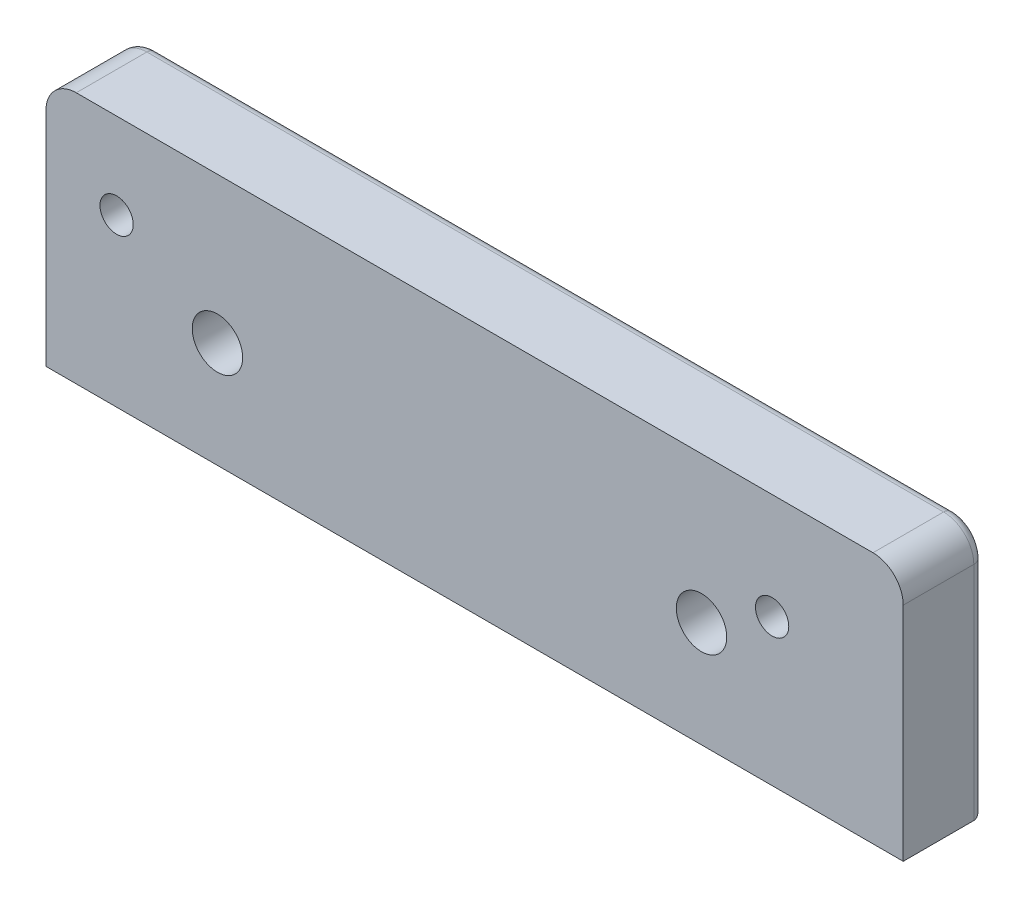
from build123d import *

# Parameters (mm, degrees)
ESQUISSE1_W                = 85
ESQUISSE1_H                = 25
BASE_EXTRUSION_DEPTH       = 8
CONG_1_R                   = 3
CONG_4_R                   = 1
ESQUISSE2_R                = 2.5
ENL_V_MAT_EXTRU_1_DEPTH    = 8
ESQUISSE4_R                = 1.65
ENL_V_MAT_EXTRU_3_DEPTH    = 8
ESQUISSE12_R               = 4.3
ENL_V_MAT_EXTRU_6_DEPTH    = 4
ENL_V_MAT_EXTRU_7_DEPTH    = 84.553874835
R_P_TITION_LIN_AIRE1_COUNT = 85
R_P_TITION_LIN_AIRE1_PITCH = 1


with BuildPart() as part:
    # Esquisse1 → Base-Extrusion (new body)
    with BuildSketch(Plane.XY):
        with Locations((0, 2)):
            Rectangle(ESQUISSE1_W, ESQUISSE1_H)
    extrude(amount=BASE_EXTRUSION_DEPTH)

    # Cong_1
    cong_1_edges = [part.edges().sort_by_distance(p)[0] for p in [
        (42.5, 14.5, 4),
        (-42.5, 14.5, 4),
    ]]
    fillet(cong_1_edges, radius=CONG_1_R)

    # Cong_4
    cong_4_edges = [part.edges().sort_by_distance(p)[0] for p in [
        (42.5, 0.5, 0),
        (41.621320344, 13.621320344, 0),
        (0, -10.5, 0),
        (0, 14.5, 0),
        (-42.5, 0.5, 0),
        (-41.621320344, 13.621320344, 0),
    ]]
    fillet(cong_4_edges, radius=CONG_4_R)

    # Esquisse2 → Enl_v. mat.-Extru.1 (cut)
    with BuildSketch(Plane.XY.offset(8)):
        with Locations((-25.5, 0)):
            Circle(ESQUISSE2_R)
        with Locations((22.5, 0)):
            Circle(ESQUISSE2_R)
    extrude(amount=-ENL_V_MAT_EXTRU_1_DEPTH, mode=Mode.SUBTRACT)

    # Esquisse4 → Enl_v. mat.-Extru.3 (cut)
    with BuildSketch(Plane.XY.offset(8)):
        with Locations((-35.5, 6)):
            Circle(ESQUISSE4_R)
        with Locations((29.5, 4)):
            Circle(ESQUISSE4_R)
    extrude(amount=-ENL_V_MAT_EXTRU_3_DEPTH, mode=Mode.SUBTRACT)

    # Esquisse12 → Enl_v. mat.-Extru.6 (cut)
    with BuildSketch(Plane(origin=(0, 0, 0), x_dir=(-1, 0, 0), z_dir=(0, 0, -1))):
        with Locations((-22.5, 0)):
            Circle(ESQUISSE12_R)
        with Locations((25.5, 0)):
            Circle(ESQUISSE12_R)
    extrude(amount=-ENL_V_MAT_EXTRU_6_DEPTH, mode=Mode.SUBTRACT)

    # Esquisse13 → Enl_v. mat.-Extru.7 (cut, through all)
    with BuildSketch(Plane(origin=(37, 14.5, 2), x_dir=(-1, 0, 0), z_dir=(0, 1, 0))):
        Polygon((-5.100679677, -2.2), (-4.300679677, -2.2), (-4.700679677, -1.8), align=None)
    enl_v_mat_extru_7 = extrude(amount=-ENL_V_MAT_EXTRU_7_DEPTH, mode=Mode.SUBTRACT)

    # R_p_tition lin_aire1: Enl_v. mat.-Extru.7 ×85
    with Locations(*[(-i * R_P_TITION_LIN_AIRE1_PITCH, 0, 0) for i in range(1, R_P_TITION_LIN_AIRE1_COUNT)]):
        add(enl_v_mat_extru_7, mode=Mode.SUBTRACT)


solid = part.part
